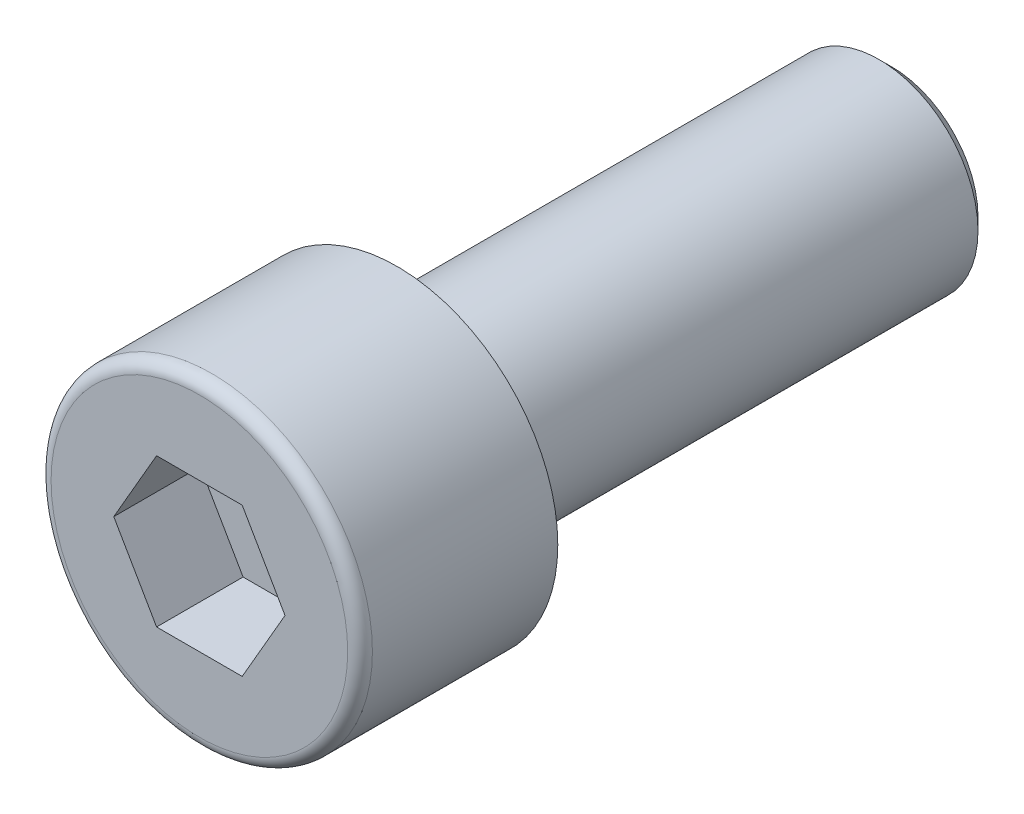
ISO-10303-21;
HEADER;
FILE_DESCRIPTION(('STEP AP214'),'2;1');
FILE_NAME('part.step','',(''),(''),'','','');
FILE_SCHEMA(('AUTOMOTIVE_DESIGN { 1 0 10303 214 1 1 1 1 }'));
ENDSEC;
DATA;
#1=APPLICATION_CONTEXT('core data for automotive mechanical design processes');
#2=APPLICATION_PROTOCOL_DEFINITION('international standard','automotive_design',2000,#1);
#3=PRODUCT_CONTEXT('',#1,'mechanical');
#4=PRODUCT('Part','Part','',(#3));
#5=PRODUCT_RELATED_PRODUCT_CATEGORY('part','',(#4));
#6=PRODUCT_DEFINITION_FORMATION('','',#4);
#7=PRODUCT_DEFINITION_CONTEXT('part definition',#1,'design');
#8=PRODUCT_DEFINITION('design','',#6,#7);
#9=PRODUCT_DEFINITION_SHAPE('','',#8);
#10=(LENGTH_UNIT() NAMED_UNIT(*) SI_UNIT(.MILLI.,.METRE.));
#11=(NAMED_UNIT(*) PLANE_ANGLE_UNIT() SI_UNIT($,.RADIAN.));
#12=(NAMED_UNIT(*) SI_UNIT($,.STERADIAN.) SOLID_ANGLE_UNIT());
#13=UNCERTAINTY_MEASURE_WITH_UNIT(LENGTH_MEASURE(1.E-05),#10,'distance_accuracy_value','');
#14=(GEOMETRIC_REPRESENTATION_CONTEXT(3) GLOBAL_UNCERTAINTY_ASSIGNED_CONTEXT((#13)) GLOBAL_UNIT_ASSIGNED_CONTEXT((#10,
#11,#12)) REPRESENTATION_CONTEXT('',''));
#15=CARTESIAN_POINT('',(0.,0.,0.));
#16=DIRECTION('',(0.,0.,1.));
#17=DIRECTION('',(1.,0.,0.));
#18=AXIS2_PLACEMENT_3D('',#15,#16,#17);
#19=CARTESIAN_POINT('',(0.,0.,20.));
#20=DIRECTION('',(0.,0.,-1.));
#21=DIRECTION('',(-1.,0.,0.));
#22=AXIS2_PLACEMENT_3D('',#19,#20,#21);
#23=CYLINDRICAL_SURFACE('',#22,4.);
#24=CARTESIAN_POINT('',(0.,0.,0.500000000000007));
#25=DIRECTION('',(0.,0.,1.));
#26=DIRECTION('',(1.,0.,0.));
#27=AXIS2_PLACEMENT_3D('',#24,#25,#26);
#28=CIRCLE('',#27,4.);
#29=CARTESIAN_POINT('',(4.,0.,0.500000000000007));
#30=VERTEX_POINT('',#29);
#31=EDGE_CURVE('E39',#30,#30,#28,.T.);
#32=ORIENTED_EDGE('',*,*,#31,.T.);
#33=EDGE_LOOP('',(#32));
#34=FACE_BOUND('',#33,.T.);
#35=CARTESIAN_POINT('',(0.,0.,20.));
#36=DIRECTION('',(0.,0.,1.));
#37=DIRECTION('',(1.,0.,0.));
#38=AXIS2_PLACEMENT_3D('',#35,#36,#37);
#39=CIRCLE('',#38,4.);
#40=CARTESIAN_POINT('',(4.,0.,20.));
#41=VERTEX_POINT('',#40);
#42=EDGE_CURVE('E142',#41,#41,#39,.T.);
#43=ORIENTED_EDGE('',*,*,#42,.F.);
#44=EDGE_LOOP('',(#43));
#45=FACE_BOUND('',#44,.T.);
#46=ADVANCED_FACE('F32',(#34,#45),#23,.T.);
#47=CARTESIAN_POINT('',(0.,0.,0.));
#48=DIRECTION('',(0.,0.,1.));
#49=DIRECTION('',(1.,0.,0.));
#50=AXIS2_PLACEMENT_3D('',#47,#48,#49);
#51=PLANE('',#50);
#52=CARTESIAN_POINT('',(0.,0.,0.));
#53=DIRECTION('',(0.,0.,1.));
#54=DIRECTION('',(1.,0.,0.));
#55=AXIS2_PLACEMENT_3D('',#52,#53,#54);
#56=CIRCLE('',#55,3.5);
#57=CARTESIAN_POINT('',(3.5,0.,0.));
#58=VERTEX_POINT('',#57);
#59=EDGE_CURVE('E11',#58,#58,#56,.F.);
#60=ORIENTED_EDGE('',*,*,#59,.T.);
#61=EDGE_LOOP('',(#60));
#62=FACE_BOUND('',#61,.T.);
#63=ADVANCED_FACE('F168',(#62),#51,.F.);
#64=CARTESIAN_POINT('',(0.,0.,20.));
#65=DIRECTION('',(0.,0.,1.));
#66=DIRECTION('',(1.,0.,0.));
#67=AXIS2_PLACEMENT_3D('',#64,#65,#66);
#68=PLANE('',#67);
#69=CARTESIAN_POINT('',(0.,0.,20.));
#70=DIRECTION('',(0.,0.,1.));
#71=DIRECTION('',(1.,0.,0.));
#72=AXIS2_PLACEMENT_3D('',#69,#70,#71);
#73=CIRCLE('',#72,6.5);
#74=CARTESIAN_POINT('',(6.5,0.,20.));
#75=VERTEX_POINT('',#74);
#76=EDGE_CURVE('E133',#75,#75,#73,.T.);
#77=ORIENTED_EDGE('',*,*,#76,.F.);
#78=EDGE_LOOP('',(#77));
#79=FACE_BOUND('',#78,.T.);
#80=ORIENTED_EDGE('',*,*,#42,.T.);
#81=EDGE_LOOP('',(#80));
#82=FACE_BOUND('',#81,.T.);
#83=ADVANCED_FACE('F172',(#79,#82),#68,.F.);
#84=CARTESIAN_POINT('',(0.,0.,28.));
#85=DIRECTION('',(0.,0.,-1.));
#86=DIRECTION('',(-1.,0.,0.));
#87=AXIS2_PLACEMENT_3D('',#84,#85,#86);
#88=CYLINDRICAL_SURFACE('',#87,6.5);
#89=CARTESIAN_POINT('',(0.,0.,27.5));
#90=DIRECTION('',(0.,0.,1.));
#91=DIRECTION('',(1.,0.,0.));
#92=AXIS2_PLACEMENT_3D('',#89,#90,#91);
#93=CIRCLE('',#92,6.5);
#94=CARTESIAN_POINT('',(6.5,0.,27.5));
#95=VERTEX_POINT('',#94);
#96=EDGE_CURVE('E148',#95,#95,#93,.F.);
#97=ORIENTED_EDGE('',*,*,#96,.T.);
#98=EDGE_LOOP('',(#97));
#99=FACE_BOUND('',#98,.T.);
#100=ORIENTED_EDGE('',*,*,#76,.T.);
#101=EDGE_LOOP('',(#100));
#102=FACE_BOUND('',#101,.T.);
#103=ADVANCED_FACE('F177',(#99,#102),#88,.T.);
#104=CARTESIAN_POINT('',(0.,0.,28.));
#105=DIRECTION('',(0.,0.,1.));
#106=DIRECTION('',(1.,0.,0.));
#107=AXIS2_PLACEMENT_3D('',#104,#105,#106);
#108=PLANE('',#107);
#109=CARTESIAN_POINT('',(0.,0.,28.));
#110=DIRECTION('',(0.,0.,1.));
#111=DIRECTION('',(1.,0.,0.));
#112=AXIS2_PLACEMENT_3D('',#109,#110,#111);
#113=CIRCLE('',#112,6.);
#114=CARTESIAN_POINT('',(6.,0.,28.));
#115=VERTEX_POINT('',#114);
#116=EDGE_CURVE('E145',#115,#115,#113,.T.);
#117=ORIENTED_EDGE('',*,*,#116,.T.);
#118=EDGE_LOOP('',(#117));
#119=FACE_BOUND('',#118,.T.);
#120=DIRECTION('',(0.5,0.866025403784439,0.));
#121=VECTOR('',#120,1.);
#122=CARTESIAN_POINT('',(3.46410161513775,0.,28.));
#123=LINE('',#122,#121);
#124=CARTESIAN_POINT('',(1.73205080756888,-3.,28.));
#125=VERTEX_POINT('',#124);
#126=CARTESIAN_POINT('',(3.46410161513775,0.,28.));
#127=VERTEX_POINT('',#126);
#128=EDGE_CURVE('E46',#125,#127,#123,.T.);
#129=ORIENTED_EDGE('',*,*,#128,.F.);
#130=DIRECTION('',(1.,0.,0.));
#131=VECTOR('',#130,1.);
#132=CARTESIAN_POINT('',(-1.73205080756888,-3.,28.));
#133=LINE('',#132,#131);
#134=CARTESIAN_POINT('',(-1.73205080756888,-3.,28.));
#135=VERTEX_POINT('',#134);
#136=EDGE_CURVE('E115',#135,#125,#133,.T.);
#137=ORIENTED_EDGE('',*,*,#136,.F.);
#138=DIRECTION('',(0.5,-0.866025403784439,0.));
#139=VECTOR('',#138,1.);
#140=CARTESIAN_POINT('',(-3.46410161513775,0.,28.));
#141=LINE('',#140,#139);
#142=CARTESIAN_POINT('',(-3.46410161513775,0.,28.));
#143=VERTEX_POINT('',#142);
#144=EDGE_CURVE('E109',#143,#135,#141,.T.);
#145=ORIENTED_EDGE('',*,*,#144,.F.);
#146=DIRECTION('',(-0.5,-0.866025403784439,0.));
#147=VECTOR('',#146,1.);
#148=CARTESIAN_POINT('',(-3.46410161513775,0.,28.));
#149=LINE('',#148,#147);
#150=CARTESIAN_POINT('',(-1.73205080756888,3.,28.));
#151=VERTEX_POINT('',#150);
#152=EDGE_CURVE('E107',#151,#143,#149,.T.);
#153=ORIENTED_EDGE('',*,*,#152,.F.);
#154=DIRECTION('',(-1.,0.,0.));
#155=VECTOR('',#154,1.);
#156=CARTESIAN_POINT('',(-1.73205080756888,3.,28.));
#157=LINE('',#156,#155);
#158=CARTESIAN_POINT('',(1.73205080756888,3.,28.));
#159=VERTEX_POINT('',#158);
#160=EDGE_CURVE('E89',#159,#151,#157,.T.);
#161=ORIENTED_EDGE('',*,*,#160,.F.);
#162=DIRECTION('',(-0.5,0.866025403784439,0.));
#163=VECTOR('',#162,1.);
#164=CARTESIAN_POINT('',(3.46410161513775,0.,28.));
#165=LINE('',#164,#163);
#166=EDGE_CURVE('E100',#127,#159,#165,.T.);
#167=ORIENTED_EDGE('',*,*,#166,.F.);
#168=EDGE_LOOP('',(#129,#137,#145,#153,#161,#167));
#169=FACE_BOUND('',#168,.T.);
#170=ADVANCED_FACE('F104',(#119,#169),#108,.T.);
#171=CARTESIAN_POINT('',(3.46410161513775,0.,24.5));
#172=DIRECTION('',(0.866025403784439,-0.5,0.));
#173=DIRECTION('',(0.5,0.866025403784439,0.));
#174=AXIS2_PLACEMENT_3D('',#171,#172,#173);
#175=PLANE('',#174);
#176=ORIENTED_EDGE('',*,*,#128,.T.);
#177=DIRECTION('',(0.,0.,1.));
#178=VECTOR('',#177,1.);
#179=CARTESIAN_POINT('',(3.46410161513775,0.,24.5));
#180=LINE('',#179,#178);
#181=CARTESIAN_POINT('',(3.46410161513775,0.,24.5));
#182=VERTEX_POINT('',#181);
#183=EDGE_CURVE('E97',#182,#127,#180,.T.);
#184=ORIENTED_EDGE('',*,*,#183,.F.);
#185=DIRECTION('',(0.5,0.866025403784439,0.));
#186=VECTOR('',#185,1.);
#187=CARTESIAN_POINT('',(3.46410161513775,0.,24.5));
#188=LINE('',#187,#186);
#189=CARTESIAN_POINT('',(1.73205080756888,-3.,24.5));
#190=VERTEX_POINT('',#189);
#191=EDGE_CURVE('E117',#190,#182,#188,.T.);
#192=ORIENTED_EDGE('',*,*,#191,.F.);
#193=DIRECTION('',(0.,0.,1.));
#194=VECTOR('',#193,1.);
#195=CARTESIAN_POINT('',(1.73205080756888,-3.,24.5));
#196=LINE('',#195,#194);
#197=EDGE_CURVE('E53',#190,#125,#196,.T.);
#198=ORIENTED_EDGE('',*,*,#197,.T.);
#199=EDGE_LOOP('',(#176,#184,#192,#198));
#200=FACE_BOUND('',#199,.T.);
#201=ADVANCED_FACE('F185',(#200),#175,.F.);
#202=CARTESIAN_POINT('',(-1.73205080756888,-3.,24.5));
#203=DIRECTION('',(0.,-1.,0.));
#204=DIRECTION('',(0.,0.,-1.));
#205=AXIS2_PLACEMENT_3D('',#202,#203,#204);
#206=PLANE('',#205);
#207=ORIENTED_EDGE('',*,*,#136,.T.);
#208=ORIENTED_EDGE('',*,*,#197,.F.);
#209=DIRECTION('',(1.,0.,0.));
#210=VECTOR('',#209,1.);
#211=CARTESIAN_POINT('',(-1.73205080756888,-3.,24.5));
#212=LINE('',#211,#210);
#213=CARTESIAN_POINT('',(-1.73205080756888,-3.,24.5));
#214=VERTEX_POINT('',#213);
#215=EDGE_CURVE('E129',#214,#190,#212,.T.);
#216=ORIENTED_EDGE('',*,*,#215,.F.);
#217=DIRECTION('',(0.,0.,1.));
#218=VECTOR('',#217,1.);
#219=CARTESIAN_POINT('',(-1.73205080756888,-3.,24.5));
#220=LINE('',#219,#218);
#221=EDGE_CURVE('E134',#214,#135,#220,.T.);
#222=ORIENTED_EDGE('',*,*,#221,.T.);
#223=EDGE_LOOP('',(#207,#208,#216,#222));
#224=FACE_BOUND('',#223,.T.);
#225=ADVANCED_FACE('F190',(#224),#206,.F.);
#226=CARTESIAN_POINT('',(-3.46410161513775,0.,24.5));
#227=DIRECTION('',(-0.866025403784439,-0.5,0.));
#228=DIRECTION('',(0.5,-0.866025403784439,0.));
#229=AXIS2_PLACEMENT_3D('',#226,#227,#228);
#230=PLANE('',#229);
#231=ORIENTED_EDGE('',*,*,#144,.T.);
#232=ORIENTED_EDGE('',*,*,#221,.F.);
#233=DIRECTION('',(0.5,-0.866025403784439,0.));
#234=VECTOR('',#233,1.);
#235=CARTESIAN_POINT('',(-3.46410161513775,0.,24.5));
#236=LINE('',#235,#234);
#237=CARTESIAN_POINT('',(-3.46410161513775,0.,24.5));
#238=VERTEX_POINT('',#237);
#239=EDGE_CURVE('E126',#238,#214,#236,.T.);
#240=ORIENTED_EDGE('',*,*,#239,.F.);
#241=DIRECTION('',(0.,0.,1.));
#242=VECTOR('',#241,1.);
#243=CARTESIAN_POINT('',(-3.46410161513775,0.,24.5));
#244=LINE('',#243,#242);
#245=EDGE_CURVE('E136',#238,#143,#244,.T.);
#246=ORIENTED_EDGE('',*,*,#245,.T.);
#247=EDGE_LOOP('',(#231,#232,#240,#246));
#248=FACE_BOUND('',#247,.T.);
#249=ADVANCED_FACE('F198',(#248),#230,.F.);
#250=CARTESIAN_POINT('',(-3.46410161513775,0.,24.5));
#251=DIRECTION('',(-0.866025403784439,0.5,0.));
#252=DIRECTION('',(-0.5,-0.866025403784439,0.));
#253=AXIS2_PLACEMENT_3D('',#250,#251,#252);
#254=PLANE('',#253);
#255=ORIENTED_EDGE('',*,*,#152,.T.);
#256=ORIENTED_EDGE('',*,*,#245,.F.);
#257=DIRECTION('',(-0.5,-0.866025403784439,0.));
#258=VECTOR('',#257,1.);
#259=CARTESIAN_POINT('',(-3.46410161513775,0.,24.5));
#260=LINE('',#259,#258);
#261=CARTESIAN_POINT('',(-1.73205080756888,3.,24.5));
#262=VERTEX_POINT('',#261);
#263=EDGE_CURVE('E123',#262,#238,#260,.T.);
#264=ORIENTED_EDGE('',*,*,#263,.F.);
#265=DIRECTION('',(0.,0.,1.));
#266=VECTOR('',#265,1.);
#267=CARTESIAN_POINT('',(-1.73205080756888,3.,24.5));
#268=LINE('',#267,#266);
#269=EDGE_CURVE('E96',#262,#151,#268,.T.);
#270=ORIENTED_EDGE('',*,*,#269,.T.);
#271=EDGE_LOOP('',(#255,#256,#264,#270));
#272=FACE_BOUND('',#271,.T.);
#273=ADVANCED_FACE('F195',(#272),#254,.F.);
#274=CARTESIAN_POINT('',(-1.73205080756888,3.,24.5));
#275=DIRECTION('',(0.,1.,0.));
#276=DIRECTION('',(0.,0.,1.));
#277=AXIS2_PLACEMENT_3D('',#274,#275,#276);
#278=PLANE('',#277);
#279=ORIENTED_EDGE('',*,*,#160,.T.);
#280=ORIENTED_EDGE('',*,*,#269,.F.);
#281=DIRECTION('',(-1.,0.,0.));
#282=VECTOR('',#281,1.);
#283=CARTESIAN_POINT('',(-1.73205080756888,3.,24.5));
#284=LINE('',#283,#282);
#285=CARTESIAN_POINT('',(1.73205080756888,3.,24.5));
#286=VERTEX_POINT('',#285);
#287=EDGE_CURVE('E92',#286,#262,#284,.T.);
#288=ORIENTED_EDGE('',*,*,#287,.F.);
#289=DIRECTION('',(0.,0.,1.));
#290=VECTOR('',#289,1.);
#291=CARTESIAN_POINT('',(1.73205080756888,3.,24.5));
#292=LINE('',#291,#290);
#293=EDGE_CURVE('E85',#286,#159,#292,.T.);
#294=ORIENTED_EDGE('',*,*,#293,.T.);
#295=EDGE_LOOP('',(#279,#280,#288,#294));
#296=FACE_BOUND('',#295,.T.);
#297=ADVANCED_FACE('F87',(#296),#278,.F.);
#298=CARTESIAN_POINT('',(3.46410161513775,0.,24.5));
#299=DIRECTION('',(0.866025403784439,0.5,0.));
#300=DIRECTION('',(-0.5,0.866025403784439,0.));
#301=AXIS2_PLACEMENT_3D('',#298,#299,#300);
#302=PLANE('',#301);
#303=ORIENTED_EDGE('',*,*,#166,.T.);
#304=ORIENTED_EDGE('',*,*,#293,.F.);
#305=DIRECTION('',(-0.5,0.866025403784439,0.));
#306=VECTOR('',#305,1.);
#307=CARTESIAN_POINT('',(3.46410161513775,0.,24.5));
#308=LINE('',#307,#306);
#309=EDGE_CURVE('E120',#182,#286,#308,.T.);
#310=ORIENTED_EDGE('',*,*,#309,.F.);
#311=ORIENTED_EDGE('',*,*,#183,.T.);
#312=EDGE_LOOP('',(#303,#304,#310,#311));
#313=FACE_BOUND('',#312,.T.);
#314=ADVANCED_FACE('F101',(#313),#302,.F.);
#315=CARTESIAN_POINT('',(1.73205080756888,-3.,24.5));
#316=DIRECTION('',(0.,0.,1.));
#317=DIRECTION('',(1.,0.,0.));
#318=AXIS2_PLACEMENT_3D('',#315,#316,#317);
#319=PLANE('',#318);
#320=ORIENTED_EDGE('',*,*,#191,.T.);
#321=ORIENTED_EDGE('',*,*,#309,.T.);
#322=ORIENTED_EDGE('',*,*,#287,.T.);
#323=ORIENTED_EDGE('',*,*,#263,.T.);
#324=ORIENTED_EDGE('',*,*,#239,.T.);
#325=ORIENTED_EDGE('',*,*,#215,.T.);
#326=EDGE_LOOP('',(#320,#321,#322,#323,#324,#325));
#327=FACE_BOUND('',#326,.T.);
#328=ADVANCED_FACE('F163',(#327),#319,.T.);
#329=CARTESIAN_POINT('',(0.,0.,27.5));
#330=DIRECTION('',(0.,0.,1.));
#331=DIRECTION('',(1.,0.,0.));
#332=AXIS2_PLACEMENT_3D('',#329,#330,#331);
#333=TOROIDAL_SURFACE('',#332,6.,0.5);
#334=ORIENTED_EDGE('',*,*,#96,.F.);
#335=EDGE_LOOP('',(#334));
#336=FACE_BOUND('',#335,.T.);
#337=ORIENTED_EDGE('',*,*,#116,.F.);
#338=EDGE_LOOP('',(#337));
#339=FACE_BOUND('',#338,.T.);
#340=ADVANCED_FACE('F157',(#336,#339),#333,.T.);
#341=CARTESIAN_POINT('',(0.,0.,0.500000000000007));
#342=DIRECTION('',(0.,0.,1.));
#343=DIRECTION('',(1.,0.,0.));
#344=AXIS2_PLACEMENT_3D('',#341,#342,#343);
#345=CONICAL_SURFACE('',#344,4.,0.785398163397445);
#346=ORIENTED_EDGE('',*,*,#59,.F.);
#347=EDGE_LOOP('',(#346));
#348=FACE_BOUND('',#347,.T.);
#349=ORIENTED_EDGE('',*,*,#31,.F.);
#350=EDGE_LOOP('',(#349));
#351=FACE_BOUND('',#350,.T.);
#352=ADVANCED_FACE('F155',(#348,#351),#345,.T.);
#353=CLOSED_SHELL('',(#46,#63,#83,#103,#170,#201,#225,#249,#273,#297,#314,#328,#340,#352));
#354=MANIFOLD_SOLID_BREP('B2',#353);
#355=ADVANCED_BREP_SHAPE_REPRESENTATION('',(#18,#354),#14);
#356=SHAPE_DEFINITION_REPRESENTATION(#9,#355);
ENDSEC;
END-ISO-10303-21;
